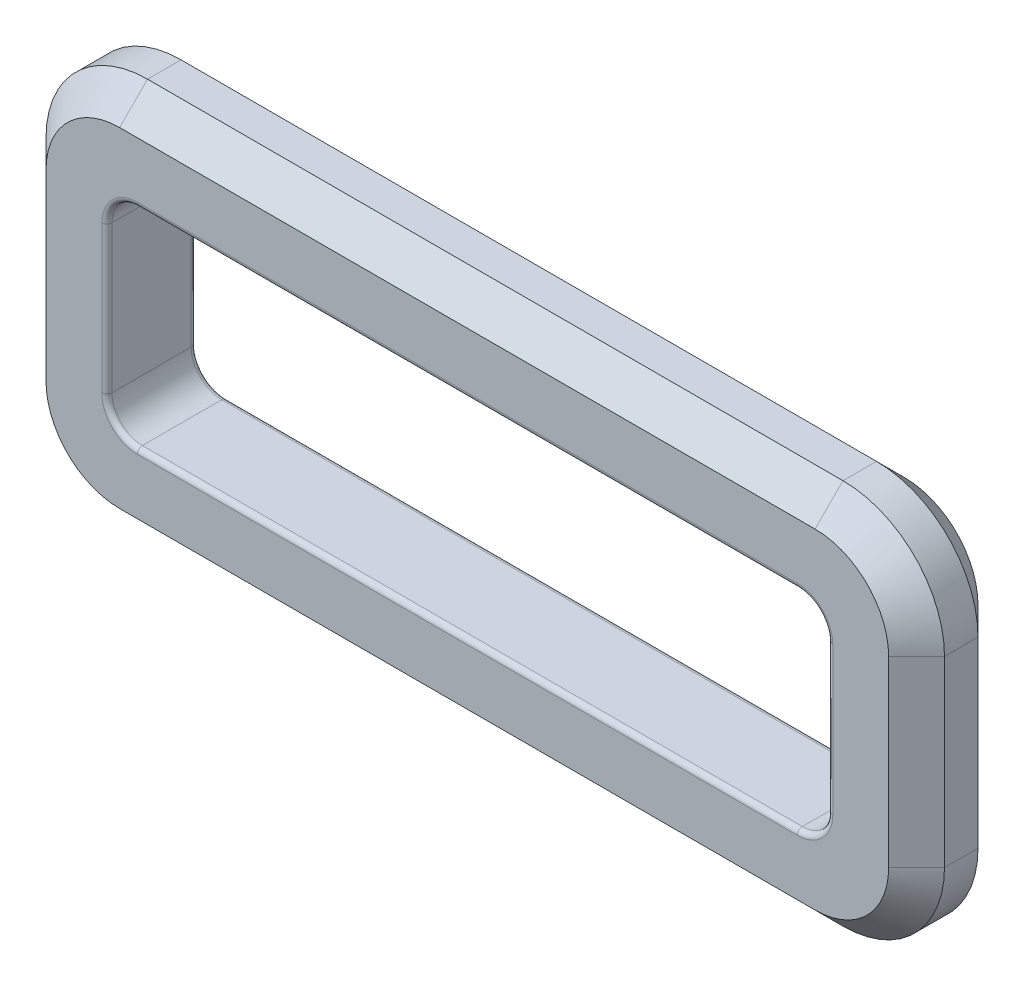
ISO-10303-21;
HEADER;
FILE_DESCRIPTION(('STEP AP214'),'2;1');
FILE_NAME('part.step','',(''),(''),'','','');
FILE_SCHEMA(('AUTOMOTIVE_DESIGN { 1 0 10303 214 1 1 1 1 }'));
ENDSEC;
DATA;
#1=APPLICATION_CONTEXT('core data for automotive mechanical design processes');
#2=APPLICATION_PROTOCOL_DEFINITION('international standard','automotive_design',2000,#1);
#3=PRODUCT_CONTEXT('',#1,'mechanical');
#4=PRODUCT('Part','Part','',(#3));
#5=PRODUCT_RELATED_PRODUCT_CATEGORY('part','',(#4));
#6=PRODUCT_DEFINITION_FORMATION('','',#4);
#7=PRODUCT_DEFINITION_CONTEXT('part definition',#1,'design');
#8=PRODUCT_DEFINITION('design','',#6,#7);
#9=PRODUCT_DEFINITION_SHAPE('','',#8);
#10=(LENGTH_UNIT() NAMED_UNIT(*) SI_UNIT(.MILLI.,.METRE.));
#11=(NAMED_UNIT(*) PLANE_ANGLE_UNIT() SI_UNIT($,.RADIAN.));
#12=(NAMED_UNIT(*) SI_UNIT($,.STERADIAN.) SOLID_ANGLE_UNIT());
#13=UNCERTAINTY_MEASURE_WITH_UNIT(LENGTH_MEASURE(1.E-05),#10,'distance_accuracy_value','');
#14=(GEOMETRIC_REPRESENTATION_CONTEXT(3) GLOBAL_UNCERTAINTY_ASSIGNED_CONTEXT((#13)) GLOBAL_UNIT_ASSIGNED_CONTEXT((#10,
#11,#12)) REPRESENTATION_CONTEXT('',''));
#15=CARTESIAN_POINT('',(0.,0.,0.));
#16=DIRECTION('',(0.,0.,1.));
#17=DIRECTION('',(1.,0.,0.));
#18=AXIS2_PLACEMENT_3D('',#15,#16,#17);
#19=CARTESIAN_POINT('',(3.425,-0.9,0.88));
#20=DIRECTION('',(0.,0.,1.));
#21=DIRECTION('',(1.,0.,0.));
#22=AXIS2_PLACEMENT_3D('',#19,#20,#21);
#23=PLANE('',#22);
#24=CARTESIAN_POINT('',(-3.425,-0.9,0.88));
#25=DIRECTION('',(0.,0.,1.));
#26=DIRECTION('',(1.,0.,0.));
#27=AXIS2_PLACEMENT_3D('',#24,#25,#26);
#28=CIRCLE('',#27,0.724999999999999);
#29=CARTESIAN_POINT('',(-4.15,-0.9,0.88));
#30=VERTEX_POINT('',#29);
#31=CARTESIAN_POINT('',(-3.42499999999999,-1.625,0.88));
#32=VERTEX_POINT('',#31);
#33=EDGE_CURVE('E67',#30,#32,#28,.T.);
#34=ORIENTED_EDGE('',*,*,#33,.T.);
#35=DIRECTION('',(1.,0.,0.));
#36=VECTOR('',#35,1.);
#37=CARTESIAN_POINT('',(3.42499999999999,-1.625,0.88));
#38=LINE('',#37,#36);
#39=CARTESIAN_POINT('',(3.42499999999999,-1.625,0.88));
#40=VERTEX_POINT('',#39);
#41=EDGE_CURVE('E11',#32,#40,#38,.T.);
#42=ORIENTED_EDGE('',*,*,#41,.T.);
#43=CARTESIAN_POINT('',(3.425,-0.9,0.88));
#44=DIRECTION('',(0.,0.,1.));
#45=DIRECTION('',(1.,0.,0.));
#46=AXIS2_PLACEMENT_3D('',#43,#44,#45);
#47=CIRCLE('',#46,0.724999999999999);
#48=CARTESIAN_POINT('',(4.15,-0.899999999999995,0.88));
#49=VERTEX_POINT('',#48);
#50=EDGE_CURVE('E52',#40,#49,#47,.T.);
#51=ORIENTED_EDGE('',*,*,#50,.T.);
#52=DIRECTION('',(0.,1.,0.));
#53=VECTOR('',#52,1.);
#54=CARTESIAN_POINT('',(4.15,0.899999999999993,0.88));
#55=LINE('',#54,#53);
#56=CARTESIAN_POINT('',(4.15,0.899999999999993,0.88));
#57=VERTEX_POINT('',#56);
#58=EDGE_CURVE('E507',#49,#57,#55,.T.);
#59=ORIENTED_EDGE('',*,*,#58,.T.);
#60=CARTESIAN_POINT('',(3.425,0.9,0.88));
#61=DIRECTION('',(0.,0.,1.));
#62=DIRECTION('',(1.,0.,0.));
#63=AXIS2_PLACEMENT_3D('',#60,#61,#62);
#64=CIRCLE('',#63,0.724999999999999);
#65=CARTESIAN_POINT('',(3.42499999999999,1.625,0.88));
#66=VERTEX_POINT('',#65);
#67=EDGE_CURVE('E501',#57,#66,#64,.T.);
#68=ORIENTED_EDGE('',*,*,#67,.T.);
#69=DIRECTION('',(-1.,0.,0.));
#70=VECTOR('',#69,1.);
#71=CARTESIAN_POINT('',(-3.42499999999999,1.625,0.88));
#72=LINE('',#71,#70);
#73=CARTESIAN_POINT('',(-3.42499999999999,1.625,0.88));
#74=VERTEX_POINT('',#73);
#75=EDGE_CURVE('E495',#66,#74,#72,.T.);
#76=ORIENTED_EDGE('',*,*,#75,.T.);
#77=CARTESIAN_POINT('',(-3.425,0.9,0.88));
#78=DIRECTION('',(0.,0.,1.));
#79=DIRECTION('',(1.,0.,0.));
#80=AXIS2_PLACEMENT_3D('',#77,#78,#79);
#81=CIRCLE('',#80,0.724999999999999);
#82=CARTESIAN_POINT('',(-4.15,0.899999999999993,0.88));
#83=VERTEX_POINT('',#82);
#84=EDGE_CURVE('E498',#74,#83,#81,.T.);
#85=ORIENTED_EDGE('',*,*,#84,.T.);
#86=DIRECTION('',(0.,-1.,0.));
#87=VECTOR('',#86,1.);
#88=CARTESIAN_POINT('',(-4.15,-0.9,0.88));
#89=LINE('',#88,#87);
#90=EDGE_CURVE('E504',#83,#30,#89,.T.);
#91=ORIENTED_EDGE('',*,*,#90,.T.);
#92=EDGE_LOOP('',(#34,#42,#51,#59,#68,#76,#85,#91));
#93=FACE_BOUND('',#92,.T.);
#94=DIRECTION('',(0.,-1.,0.));
#95=VECTOR('',#94,1.);
#96=CARTESIAN_POINT('',(-3.6,-0.9,0.88));
#97=LINE('',#96,#95);
#98=CARTESIAN_POINT('',(-3.6,-0.724999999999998,0.88));
#99=VERTEX_POINT('',#98);
#100=CARTESIAN_POINT('',(-3.6,0.724999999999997,0.88));
#101=VERTEX_POINT('',#100);
#102=EDGE_CURVE('E334',#99,#101,#97,.F.);
#103=ORIENTED_EDGE('',*,*,#102,.T.);
#104=CARTESIAN_POINT('',(-3.25,0.725,0.88));
#105=DIRECTION('',(0.,0.,1.));
#106=DIRECTION('',(1.,0.,0.));
#107=AXIS2_PLACEMENT_3D('',#104,#105,#106);
#108=CIRCLE('',#107,0.35);
#109=CARTESIAN_POINT('',(-3.25,1.075,0.88));
#110=VERTEX_POINT('',#109);
#111=EDGE_CURVE('E355',#101,#110,#108,.F.);
#112=ORIENTED_EDGE('',*,*,#111,.T.);
#113=DIRECTION('',(-1.,0.,0.));
#114=VECTOR('',#113,1.);
#115=CARTESIAN_POINT('',(3.425,1.075,0.88));
#116=LINE('',#115,#114);
#117=CARTESIAN_POINT('',(3.25,1.075,0.88));
#118=VERTEX_POINT('',#117);
#119=EDGE_CURVE('E352',#110,#118,#116,.F.);
#120=ORIENTED_EDGE('',*,*,#119,.T.);
#121=CARTESIAN_POINT('',(3.25,0.725,0.88));
#122=DIRECTION('',(0.,0.,1.));
#123=DIRECTION('',(1.,0.,0.));
#124=AXIS2_PLACEMENT_3D('',#121,#122,#123);
#125=CIRCLE('',#124,0.35);
#126=CARTESIAN_POINT('',(3.6,0.724999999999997,0.88));
#127=VERTEX_POINT('',#126);
#128=EDGE_CURVE('E349',#118,#127,#125,.F.);
#129=ORIENTED_EDGE('',*,*,#128,.T.);
#130=DIRECTION('',(0.,1.,0.));
#131=VECTOR('',#130,1.);
#132=CARTESIAN_POINT('',(3.6,-0.9,0.88));
#133=LINE('',#132,#131);
#134=CARTESIAN_POINT('',(3.6,-0.725,0.88));
#135=VERTEX_POINT('',#134);
#136=EDGE_CURVE('E346',#127,#135,#133,.F.);
#137=ORIENTED_EDGE('',*,*,#136,.T.);
#138=CARTESIAN_POINT('',(3.25,-0.725,0.88));
#139=DIRECTION('',(0.,0.,1.));
#140=DIRECTION('',(1.,0.,0.));
#141=AXIS2_PLACEMENT_3D('',#138,#139,#140);
#142=CIRCLE('',#141,0.35);
#143=CARTESIAN_POINT('',(3.25,-1.075,0.88));
#144=VERTEX_POINT('',#143);
#145=EDGE_CURVE('E343',#135,#144,#142,.F.);
#146=ORIENTED_EDGE('',*,*,#145,.T.);
#147=DIRECTION('',(1.,0.,0.));
#148=VECTOR('',#147,1.);
#149=CARTESIAN_POINT('',(3.425,-1.075,0.88));
#150=LINE('',#149,#148);
#151=CARTESIAN_POINT('',(-3.25,-1.075,0.88));
#152=VERTEX_POINT('',#151);
#153=EDGE_CURVE('E340',#144,#152,#150,.F.);
#154=ORIENTED_EDGE('',*,*,#153,.T.);
#155=CARTESIAN_POINT('',(-3.25,-0.725,0.88));
#156=DIRECTION('',(0.,0.,1.));
#157=DIRECTION('',(1.,0.,0.));
#158=AXIS2_PLACEMENT_3D('',#155,#156,#157);
#159=CIRCLE('',#158,0.35);
#160=EDGE_CURVE('E337',#152,#99,#159,.F.);
#161=ORIENTED_EDGE('',*,*,#160,.T.);
#162=EDGE_LOOP('',(#103,#112,#120,#129,#137,#146,#154,#161));
#163=FACE_BOUND('',#162,.T.);
#164=ADVANCED_FACE('F41',(#93,#163),#23,.T.);
#165=CARTESIAN_POINT('',(3.425,-0.9,0.));
#166=DIRECTION('',(0.,0.,1.));
#167=DIRECTION('',(1.,0.,0.));
#168=AXIS2_PLACEMENT_3D('',#165,#166,#167);
#169=PLANE('',#168);
#170=CARTESIAN_POINT('',(3.425,-0.9,0.));
#171=DIRECTION('',(0.,0.,1.));
#172=DIRECTION('',(1.,0.,0.));
#173=AXIS2_PLACEMENT_3D('',#170,#171,#172);
#174=CIRCLE('',#173,0.725);
#175=CARTESIAN_POINT('',(4.15,-0.899999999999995,0.));
#176=VERTEX_POINT('',#175);
#177=CARTESIAN_POINT('',(3.42499999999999,-1.625,0.));
#178=VERTEX_POINT('',#177);
#179=EDGE_CURVE('E446',#176,#178,#174,.F.);
#180=ORIENTED_EDGE('',*,*,#179,.T.);
#181=DIRECTION('',(-1.,0.,0.));
#182=VECTOR('',#181,1.);
#183=CARTESIAN_POINT('',(3.425,-1.625,0.));
#184=LINE('',#183,#182);
#185=CARTESIAN_POINT('',(-3.42499999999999,-1.625,0.));
#186=VERTEX_POINT('',#185);
#187=EDGE_CURVE('E449',#178,#186,#184,.T.);
#188=ORIENTED_EDGE('',*,*,#187,.T.);
#189=CARTESIAN_POINT('',(-3.425,-0.9,0.));
#190=DIRECTION('',(0.,0.,1.));
#191=DIRECTION('',(1.,0.,0.));
#192=AXIS2_PLACEMENT_3D('',#189,#190,#191);
#193=CIRCLE('',#192,0.725);
#194=CARTESIAN_POINT('',(-4.15,-0.9,0.));
#195=VERTEX_POINT('',#194);
#196=EDGE_CURVE('E443',#186,#195,#193,.F.);
#197=ORIENTED_EDGE('',*,*,#196,.T.);
#198=DIRECTION('',(0.,1.,0.));
#199=VECTOR('',#198,1.);
#200=CARTESIAN_POINT('',(-4.15,-0.9,0.));
#201=LINE('',#200,#199);
#202=CARTESIAN_POINT('',(-4.15,0.899999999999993,0.));
#203=VERTEX_POINT('',#202);
#204=EDGE_CURVE('E437',#195,#203,#201,.T.);
#205=ORIENTED_EDGE('',*,*,#204,.T.);
#206=CARTESIAN_POINT('',(-3.425,0.9,0.));
#207=DIRECTION('',(0.,0.,1.));
#208=DIRECTION('',(1.,0.,0.));
#209=AXIS2_PLACEMENT_3D('',#206,#207,#208);
#210=CIRCLE('',#209,0.725);
#211=CARTESIAN_POINT('',(-3.42499999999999,1.625,0.));
#212=VERTEX_POINT('',#211);
#213=EDGE_CURVE('E431',#203,#212,#210,.F.);
#214=ORIENTED_EDGE('',*,*,#213,.T.);
#215=DIRECTION('',(1.,0.,0.));
#216=VECTOR('',#215,1.);
#217=CARTESIAN_POINT('',(3.425,1.625,0.));
#218=LINE('',#217,#216);
#219=CARTESIAN_POINT('',(3.42499999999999,1.625,0.));
#220=VERTEX_POINT('',#219);
#221=EDGE_CURVE('E428',#212,#220,#218,.T.);
#222=ORIENTED_EDGE('',*,*,#221,.T.);
#223=CARTESIAN_POINT('',(3.425,0.9,0.));
#224=DIRECTION('',(0.,0.,1.));
#225=DIRECTION('',(1.,0.,0.));
#226=AXIS2_PLACEMENT_3D('',#223,#224,#225);
#227=CIRCLE('',#226,0.725);
#228=CARTESIAN_POINT('',(4.15,0.899999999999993,0.));
#229=VERTEX_POINT('',#228);
#230=EDGE_CURVE('E434',#220,#229,#227,.F.);
#231=ORIENTED_EDGE('',*,*,#230,.T.);
#232=DIRECTION('',(0.,-1.,0.));
#233=VECTOR('',#232,1.);
#234=CARTESIAN_POINT('',(4.15,-0.9,0.));
#235=LINE('',#234,#233);
#236=EDGE_CURVE('E440',#229,#176,#235,.T.);
#237=ORIENTED_EDGE('',*,*,#236,.T.);
#238=EDGE_LOOP('',(#180,#188,#197,#205,#214,#222,#231,#237));
#239=FACE_BOUND('',#238,.T.);
#240=DIRECTION('',(-1.,0.,0.));
#241=VECTOR('',#240,1.);
#242=CARTESIAN_POINT('',(-3.25,1.075,0.));
#243=LINE('',#242,#241);
#244=CARTESIAN_POINT('',(3.25,1.075,0.));
#245=VERTEX_POINT('',#244);
#246=CARTESIAN_POINT('',(-3.25,1.075,0.));
#247=VERTEX_POINT('',#246);
#248=EDGE_CURVE('E283',#245,#247,#243,.T.);
#249=ORIENTED_EDGE('',*,*,#248,.T.);
#250=CARTESIAN_POINT('',(-3.25,0.725,0.));
#251=DIRECTION('',(0.,0.,1.));
#252=DIRECTION('',(1.,0.,0.));
#253=AXIS2_PLACEMENT_3D('',#250,#251,#252);
#254=CIRCLE('',#253,0.35);
#255=CARTESIAN_POINT('',(-3.6,0.724999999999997,0.));
#256=VERTEX_POINT('',#255);
#257=EDGE_CURVE('E261',#247,#256,#254,.T.);
#258=ORIENTED_EDGE('',*,*,#257,.T.);
#259=DIRECTION('',(0.,-1.,0.));
#260=VECTOR('',#259,1.);
#261=CARTESIAN_POINT('',(-3.6,-0.724999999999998,0.));
#262=LINE('',#261,#260);
#263=CARTESIAN_POINT('',(-3.6,-0.724999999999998,0.));
#264=VERTEX_POINT('',#263);
#265=EDGE_CURVE('E271',#256,#264,#262,.T.);
#266=ORIENTED_EDGE('',*,*,#265,.T.);
#267=CARTESIAN_POINT('',(-3.25,-0.725,0.));
#268=DIRECTION('',(0.,0.,1.));
#269=DIRECTION('',(1.,0.,0.));
#270=AXIS2_PLACEMENT_3D('',#267,#268,#269);
#271=CIRCLE('',#270,0.35);
#272=CARTESIAN_POINT('',(-3.25,-1.075,0.));
#273=VERTEX_POINT('',#272);
#274=EDGE_CURVE('E278',#264,#273,#271,.T.);
#275=ORIENTED_EDGE('',*,*,#274,.T.);
#276=DIRECTION('',(1.,0.,0.));
#277=VECTOR('',#276,1.);
#278=CARTESIAN_POINT('',(3.25,-1.075,0.));
#279=LINE('',#278,#277);
#280=CARTESIAN_POINT('',(3.25,-1.075,0.));
#281=VERTEX_POINT('',#280);
#282=EDGE_CURVE('E610',#273,#281,#279,.T.);
#283=ORIENTED_EDGE('',*,*,#282,.T.);
#284=CARTESIAN_POINT('',(3.25,-0.725,0.));
#285=DIRECTION('',(0.,0.,1.));
#286=DIRECTION('',(1.,0.,0.));
#287=AXIS2_PLACEMENT_3D('',#284,#285,#286);
#288=CIRCLE('',#287,0.35);
#289=CARTESIAN_POINT('',(3.6,-0.725,0.));
#290=VERTEX_POINT('',#289);
#291=EDGE_CURVE('E613',#281,#290,#288,.T.);
#292=ORIENTED_EDGE('',*,*,#291,.T.);
#293=DIRECTION('',(0.,1.,0.));
#294=VECTOR('',#293,1.);
#295=CARTESIAN_POINT('',(3.6,0.724999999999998,0.));
#296=LINE('',#295,#294);
#297=CARTESIAN_POINT('',(3.6,0.724999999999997,0.));
#298=VERTEX_POINT('',#297);
#299=EDGE_CURVE('E616',#290,#298,#296,.T.);
#300=ORIENTED_EDGE('',*,*,#299,.T.);
#301=CARTESIAN_POINT('',(3.25,0.725,0.));
#302=DIRECTION('',(0.,0.,1.));
#303=DIRECTION('',(1.,0.,0.));
#304=AXIS2_PLACEMENT_3D('',#301,#302,#303);
#305=CIRCLE('',#304,0.35);
#306=EDGE_CURVE('E292',#298,#245,#305,.T.);
#307=ORIENTED_EDGE('',*,*,#306,.T.);
#308=EDGE_LOOP('',(#249,#258,#266,#275,#283,#292,#300,#307));
#309=FACE_BOUND('',#308,.T.);
#310=ADVANCED_FACE('F281',(#239,#309),#169,.F.);
#311=CARTESIAN_POINT('',(3.425,-0.9,0.88));
#312=DIRECTION('',(0.,0.,-1.));
#313=DIRECTION('',(-1.,0.,0.));
#314=AXIS2_PLACEMENT_3D('',#311,#312,#313);
#315=CYLINDRICAL_SURFACE('',#314,1.);
#316=DIRECTION('',(0.,0.,-1.));
#317=VECTOR('',#316,1.);
#318=CARTESIAN_POINT('',(3.42499999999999,-1.9,0.88));
#319=LINE('',#318,#317);
#320=CARTESIAN_POINT('',(3.42499999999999,-1.9,0.604999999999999));
#321=VERTEX_POINT('',#320);
#322=CARTESIAN_POINT('',(3.42499999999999,-1.9,0.274999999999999));
#323=VERTEX_POINT('',#322);
#324=EDGE_CURVE('E648',#321,#323,#319,.T.);
#325=ORIENTED_EDGE('',*,*,#324,.T.);
#326=CARTESIAN_POINT('',(3.425,-0.9,0.274999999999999));
#327=DIRECTION('',(0.,0.,1.));
#328=DIRECTION('',(1.,0.,0.));
#329=AXIS2_PLACEMENT_3D('',#326,#327,#328);
#330=CIRCLE('',#329,1.);
#331=CARTESIAN_POINT('',(4.425,-0.899999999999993,0.274999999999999));
#332=VERTEX_POINT('',#331);
#333=EDGE_CURVE('E456',#323,#332,#330,.T.);
#334=ORIENTED_EDGE('',*,*,#333,.T.);
#335=DIRECTION('',(0.,0.,-1.));
#336=VECTOR('',#335,1.);
#337=CARTESIAN_POINT('',(4.425,-0.899999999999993,0.88));
#338=LINE('',#337,#336);
#339=CARTESIAN_POINT('',(4.425,-0.899999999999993,0.604999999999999));
#340=VERTEX_POINT('',#339);
#341=EDGE_CURVE('E279',#340,#332,#338,.T.);
#342=ORIENTED_EDGE('',*,*,#341,.F.);
#343=CARTESIAN_POINT('',(3.425,-0.9,0.604999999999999));
#344=DIRECTION('',(0.,0.,1.));
#345=DIRECTION('',(1.,0.,0.));
#346=AXIS2_PLACEMENT_3D('',#343,#344,#345);
#347=CIRCLE('',#346,1.);
#348=EDGE_CURVE('E453',#340,#321,#347,.F.);
#349=ORIENTED_EDGE('',*,*,#348,.T.);
#350=EDGE_LOOP('',(#325,#334,#342,#349));
#351=FACE_BOUND('',#350,.T.);
#352=ADVANCED_FACE('F1147',(#351),#315,.T.);
#353=CARTESIAN_POINT('',(4.425,-0.899999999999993,0.88));
#354=DIRECTION('',(-1.,0.,0.));
#355=DIRECTION('',(0.,0.,1.));
#356=AXIS2_PLACEMENT_3D('',#353,#354,#355);
#357=PLANE('',#356);
#358=ORIENTED_EDGE('',*,*,#341,.T.);
#359=DIRECTION('',(0.,1.,0.));
#360=VECTOR('',#359,1.);
#361=CARTESIAN_POINT('',(4.425,-0.899999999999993,0.274999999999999));
#362=LINE('',#361,#360);
#363=CARTESIAN_POINT('',(4.425,0.899999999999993,0.274999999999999));
#364=VERTEX_POINT('',#363);
#365=EDGE_CURVE('E468',#332,#364,#362,.T.);
#366=ORIENTED_EDGE('',*,*,#365,.T.);
#367=DIRECTION('',(0.,0.,-1.));
#368=VECTOR('',#367,1.);
#369=CARTESIAN_POINT('',(4.425,0.899999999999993,0.88));
#370=LINE('',#369,#368);
#371=CARTESIAN_POINT('',(4.425,0.899999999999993,0.604999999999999));
#372=VERTEX_POINT('',#371);
#373=EDGE_CURVE('E596',#372,#364,#370,.T.);
#374=ORIENTED_EDGE('',*,*,#373,.F.);
#375=DIRECTION('',(0.,-1.,0.));
#376=VECTOR('',#375,1.);
#377=CARTESIAN_POINT('',(4.425,-0.899999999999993,0.604999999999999));
#378=LINE('',#377,#376);
#379=EDGE_CURVE('E465',#372,#340,#378,.T.);
#380=ORIENTED_EDGE('',*,*,#379,.T.);
#381=EDGE_LOOP('',(#358,#366,#374,#380));
#382=FACE_BOUND('',#381,.T.);
#383=ADVANCED_FACE('F1140',(#382),#357,.F.);
#384=CARTESIAN_POINT('',(3.425,0.9,0.88));
#385=DIRECTION('',(0.,0.,-1.));
#386=DIRECTION('',(-1.,0.,0.));
#387=AXIS2_PLACEMENT_3D('',#384,#385,#386);
#388=CYLINDRICAL_SURFACE('',#387,1.);
#389=ORIENTED_EDGE('',*,*,#373,.T.);
#390=CARTESIAN_POINT('',(3.425,0.9,0.274999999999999));
#391=DIRECTION('',(0.,0.,1.));
#392=DIRECTION('',(1.,0.,0.));
#393=AXIS2_PLACEMENT_3D('',#390,#391,#392);
#394=CIRCLE('',#393,1.);
#395=CARTESIAN_POINT('',(3.42499999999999,1.9,0.274999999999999));
#396=VERTEX_POINT('',#395);
#397=EDGE_CURVE('E480',#364,#396,#394,.T.);
#398=ORIENTED_EDGE('',*,*,#397,.T.);
#399=DIRECTION('',(0.,0.,-1.));
#400=VECTOR('',#399,1.);
#401=CARTESIAN_POINT('',(3.42499999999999,1.9,0.88));
#402=LINE('',#401,#400);
#403=CARTESIAN_POINT('',(3.42499999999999,1.9,0.604999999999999));
#404=VERTEX_POINT('',#403);
#405=EDGE_CURVE('E586',#404,#396,#402,.T.);
#406=ORIENTED_EDGE('',*,*,#405,.F.);
#407=CARTESIAN_POINT('',(3.425,0.9,0.604999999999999));
#408=DIRECTION('',(0.,0.,1.));
#409=DIRECTION('',(1.,0.,0.));
#410=AXIS2_PLACEMENT_3D('',#407,#408,#409);
#411=CIRCLE('',#410,1.);
#412=EDGE_CURVE('E477',#404,#372,#411,.F.);
#413=ORIENTED_EDGE('',*,*,#412,.T.);
#414=EDGE_LOOP('',(#389,#398,#406,#413));
#415=FACE_BOUND('',#414,.T.);
#416=ADVANCED_FACE('F592',(#415),#388,.T.);
#417=CARTESIAN_POINT('',(-3.42499999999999,1.9,0.88));
#418=DIRECTION('',(0.,-1.,0.));
#419=DIRECTION('',(0.,0.,-1.));
#420=AXIS2_PLACEMENT_3D('',#417,#418,#419);
#421=PLANE('',#420);
#422=ORIENTED_EDGE('',*,*,#405,.T.);
#423=DIRECTION('',(-1.,0.,0.));
#424=VECTOR('',#423,1.);
#425=CARTESIAN_POINT('',(-3.42499999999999,1.9,0.274999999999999));
#426=LINE('',#425,#424);
#427=CARTESIAN_POINT('',(-3.42499999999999,1.9,0.274999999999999));
#428=VERTEX_POINT('',#427);
#429=EDGE_CURVE('E492',#396,#428,#426,.T.);
#430=ORIENTED_EDGE('',*,*,#429,.T.);
#431=DIRECTION('',(0.,0.,-1.));
#432=VECTOR('',#431,1.);
#433=CARTESIAN_POINT('',(-3.42499999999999,1.9,0.88));
#434=LINE('',#433,#432);
#435=CARTESIAN_POINT('',(-3.42499999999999,1.9,0.604999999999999));
#436=VERTEX_POINT('',#435);
#437=EDGE_CURVE('E589',#436,#428,#434,.T.);
#438=ORIENTED_EDGE('',*,*,#437,.F.);
#439=DIRECTION('',(1.,0.,0.));
#440=VECTOR('',#439,1.);
#441=CARTESIAN_POINT('',(3.42499999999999,1.9,0.604999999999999));
#442=LINE('',#441,#440);
#443=EDGE_CURVE('E489',#436,#404,#442,.T.);
#444=ORIENTED_EDGE('',*,*,#443,.T.);
#445=EDGE_LOOP('',(#422,#430,#438,#444));
#446=FACE_BOUND('',#445,.T.);
#447=ADVANCED_FACE('F585',(#446),#421,.F.);
#448=CARTESIAN_POINT('',(-3.425,0.9,0.88));
#449=DIRECTION('',(0.,0.,-1.));
#450=DIRECTION('',(-1.,0.,0.));
#451=AXIS2_PLACEMENT_3D('',#448,#449,#450);
#452=CYLINDRICAL_SURFACE('',#451,1.);
#453=ORIENTED_EDGE('',*,*,#437,.T.);
#454=CARTESIAN_POINT('',(-3.425,0.9,0.274999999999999));
#455=DIRECTION('',(0.,0.,1.));
#456=DIRECTION('',(1.,0.,0.));
#457=AXIS2_PLACEMENT_3D('',#454,#455,#456);
#458=CIRCLE('',#457,1.);
#459=CARTESIAN_POINT('',(-4.425,0.899999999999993,0.274999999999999));
#460=VERTEX_POINT('',#459);
#461=EDGE_CURVE('E486',#428,#460,#458,.T.);
#462=ORIENTED_EDGE('',*,*,#461,.T.);
#463=DIRECTION('',(0.,0.,-1.));
#464=VECTOR('',#463,1.);
#465=CARTESIAN_POINT('',(-4.425,0.899999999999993,0.88));
#466=LINE('',#465,#464);
#467=CARTESIAN_POINT('',(-4.425,0.899999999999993,0.604999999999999));
#468=VERTEX_POINT('',#467);
#469=EDGE_CURVE('E601',#468,#460,#466,.T.);
#470=ORIENTED_EDGE('',*,*,#469,.F.);
#471=CARTESIAN_POINT('',(-3.425,0.9,0.604999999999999));
#472=DIRECTION('',(0.,0.,1.));
#473=DIRECTION('',(1.,0.,0.));
#474=AXIS2_PLACEMENT_3D('',#471,#472,#473);
#475=CIRCLE('',#474,1.);
#476=EDGE_CURVE('E483',#468,#436,#475,.F.);
#477=ORIENTED_EDGE('',*,*,#476,.T.);
#478=EDGE_LOOP('',(#453,#462,#470,#477));
#479=FACE_BOUND('',#478,.T.);
#480=ADVANCED_FACE('F1121',(#479),#452,.T.);
#481=CARTESIAN_POINT('',(-4.425,-0.899999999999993,0.88));
#482=DIRECTION('',(1.,0.,0.));
#483=DIRECTION('',(0.,0.,-1.));
#484=AXIS2_PLACEMENT_3D('',#481,#482,#483);
#485=PLANE('',#484);
#486=ORIENTED_EDGE('',*,*,#469,.T.);
#487=DIRECTION('',(0.,-1.,0.));
#488=VECTOR('',#487,1.);
#489=CARTESIAN_POINT('',(-4.425,-0.899999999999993,0.274999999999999));
#490=LINE('',#489,#488);
#491=CARTESIAN_POINT('',(-4.425,-0.9,0.274999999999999));
#492=VERTEX_POINT('',#491);
#493=EDGE_CURVE('E474',#460,#492,#490,.T.);
#494=ORIENTED_EDGE('',*,*,#493,.T.);
#495=DIRECTION('',(0.,0.,-1.));
#496=VECTOR('',#495,1.);
#497=CARTESIAN_POINT('',(-4.425,-0.9,0.88));
#498=LINE('',#497,#496);
#499=CARTESIAN_POINT('',(-4.425,-0.9,0.604999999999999));
#500=VERTEX_POINT('',#499);
#501=EDGE_CURVE('E661',#500,#492,#498,.T.);
#502=ORIENTED_EDGE('',*,*,#501,.F.);
#503=DIRECTION('',(0.,1.,0.));
#504=VECTOR('',#503,1.);
#505=CARTESIAN_POINT('',(-4.425,0.899999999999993,0.604999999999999));
#506=LINE('',#505,#504);
#507=EDGE_CURVE('E471',#500,#468,#506,.T.);
#508=ORIENTED_EDGE('',*,*,#507,.T.);
#509=EDGE_LOOP('',(#486,#494,#502,#508));
#510=FACE_BOUND('',#509,.T.);
#511=ADVANCED_FACE('F669',(#510),#485,.F.);
#512=CARTESIAN_POINT('',(-3.425,-0.9,0.88));
#513=DIRECTION('',(0.,0.,-1.));
#514=DIRECTION('',(-1.,0.,0.));
#515=AXIS2_PLACEMENT_3D('',#512,#513,#514);
#516=CYLINDRICAL_SURFACE('',#515,1.);
#517=ORIENTED_EDGE('',*,*,#501,.T.);
#518=CARTESIAN_POINT('',(-3.425,-0.9,0.274999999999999));
#519=DIRECTION('',(0.,0.,1.));
#520=DIRECTION('',(1.,0.,0.));
#521=AXIS2_PLACEMENT_3D('',#518,#519,#520);
#522=CIRCLE('',#521,1.);
#523=CARTESIAN_POINT('',(-3.42499999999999,-1.9,0.274999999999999));
#524=VERTEX_POINT('',#523);
#525=EDGE_CURVE('E462',#492,#524,#522,.T.);
#526=ORIENTED_EDGE('',*,*,#525,.T.);
#527=DIRECTION('',(0.,0.,-1.));
#528=VECTOR('',#527,1.);
#529=CARTESIAN_POINT('',(-3.42499999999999,-1.9,0.88));
#530=LINE('',#529,#528);
#531=CARTESIAN_POINT('',(-3.42499999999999,-1.9,0.604999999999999));
#532=VERTEX_POINT('',#531);
#533=EDGE_CURVE('E657',#532,#524,#530,.T.);
#534=ORIENTED_EDGE('',*,*,#533,.F.);
#535=CARTESIAN_POINT('',(-3.425,-0.9,0.604999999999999));
#536=DIRECTION('',(0.,0.,1.));
#537=DIRECTION('',(1.,0.,0.));
#538=AXIS2_PLACEMENT_3D('',#535,#536,#537);
#539=CIRCLE('',#538,1.);
#540=EDGE_CURVE('E459',#532,#500,#539,.F.);
#541=ORIENTED_EDGE('',*,*,#540,.T.);
#542=EDGE_LOOP('',(#517,#526,#534,#541));
#543=FACE_BOUND('',#542,.T.);
#544=ADVANCED_FACE('F690',(#543),#516,.T.);
#545=CARTESIAN_POINT('',(-3.42499999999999,-1.9,0.88));
#546=DIRECTION('',(0.,1.,0.));
#547=DIRECTION('',(0.,0.,1.));
#548=AXIS2_PLACEMENT_3D('',#545,#546,#547);
#549=PLANE('',#548);
#550=ORIENTED_EDGE('',*,*,#533,.T.);
#551=DIRECTION('',(1.,0.,0.));
#552=VECTOR('',#551,1.);
#553=CARTESIAN_POINT('',(-3.42499999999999,-1.9,0.274999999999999));
#554=LINE('',#553,#552);
#555=EDGE_CURVE('E424',#524,#323,#554,.T.);
#556=ORIENTED_EDGE('',*,*,#555,.T.);
#557=ORIENTED_EDGE('',*,*,#324,.F.);
#558=DIRECTION('',(-1.,0.,0.));
#559=VECTOR('',#558,1.);
#560=CARTESIAN_POINT('',(-3.42499999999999,-1.9,0.604999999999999));
#561=LINE('',#560,#559);
#562=EDGE_CURVE('E364',#321,#532,#561,.T.);
#563=ORIENTED_EDGE('',*,*,#562,.T.);
#564=EDGE_LOOP('',(#550,#556,#557,#563));
#565=FACE_BOUND('',#564,.T.);
#566=ADVANCED_FACE('F692',(#565),#549,.F.);
#567=CARTESIAN_POINT('',(3.25,0.725,0.88));
#568=DIRECTION('',(0.,0.,-1.));
#569=DIRECTION('',(-1.,0.,0.));
#570=AXIS2_PLACEMENT_3D('',#567,#568,#569);
#571=CYLINDRICAL_SURFACE('',#570,0.3);
#572=DIRECTION('',(0.,0.,-1.));
#573=VECTOR('',#572,1.);
#574=CARTESIAN_POINT('',(3.25,1.025,0.88));
#575=LINE('',#574,#573);
#576=CARTESIAN_POINT('',(3.25,1.025,0.83));
#577=VERTEX_POINT('',#576);
#578=CARTESIAN_POINT('',(3.25,1.025,0.05));
#579=VERTEX_POINT('',#578);
#580=EDGE_CURVE('E644',#577,#579,#575,.T.);
#581=ORIENTED_EDGE('',*,*,#580,.T.);
#582=CARTESIAN_POINT('',(3.25,0.725,0.05));
#583=DIRECTION('',(0.,0.,1.));
#584=DIRECTION('',(1.,0.,0.));
#585=AXIS2_PLACEMENT_3D('',#582,#583,#584);
#586=CIRCLE('',#585,0.3);
#587=CARTESIAN_POINT('',(3.55,0.724999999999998,0.05));
#588=VERTEX_POINT('',#587);
#589=EDGE_CURVE('E307',#579,#588,#586,.F.);
#590=ORIENTED_EDGE('',*,*,#589,.T.);
#591=DIRECTION('',(0.,0.,-1.));
#592=VECTOR('',#591,1.);
#593=CARTESIAN_POINT('',(3.55,0.724999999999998,0.88));
#594=LINE('',#593,#592);
#595=CARTESIAN_POINT('',(3.55,0.724999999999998,0.83));
#596=VERTEX_POINT('',#595);
#597=EDGE_CURVE('E390',#596,#588,#594,.T.);
#598=ORIENTED_EDGE('',*,*,#597,.F.);
#599=CARTESIAN_POINT('',(3.25,0.725,0.83));
#600=DIRECTION('',(0.,0.,1.));
#601=DIRECTION('',(1.,0.,0.));
#602=AXIS2_PLACEMENT_3D('',#599,#600,#601);
#603=CIRCLE('',#602,0.3);
#604=EDGE_CURVE('E304',#596,#577,#603,.T.);
#605=ORIENTED_EDGE('',*,*,#604,.T.);
#606=EDGE_LOOP('',(#581,#590,#598,#605));
#607=FACE_BOUND('',#606,.T.);
#608=ADVANCED_FACE('F1093',(#607),#571,.F.);
#609=CARTESIAN_POINT('',(-3.25,1.025,0.88));
#610=DIRECTION('',(0.,-1.,0.));
#611=DIRECTION('',(0.,0.,-1.));
#612=AXIS2_PLACEMENT_3D('',#609,#610,#611);
#613=PLANE('',#612);
#614=DIRECTION('',(0.,0.,-1.));
#615=VECTOR('',#614,1.);
#616=CARTESIAN_POINT('',(-3.25,1.025,0.88));
#617=LINE('',#616,#615);
#618=CARTESIAN_POINT('',(-3.25,1.025,0.83));
#619=VERTEX_POINT('',#618);
#620=CARTESIAN_POINT('',(-3.25,1.025,0.05));
#621=VERTEX_POINT('',#620);
#622=EDGE_CURVE('E637',#619,#621,#617,.T.);
#623=ORIENTED_EDGE('',*,*,#622,.T.);
#624=DIRECTION('',(-1.,0.,0.));
#625=VECTOR('',#624,1.);
#626=CARTESIAN_POINT('',(3.25,1.025,0.05));
#627=LINE('',#626,#625);
#628=EDGE_CURVE('E301',#621,#579,#627,.F.);
#629=ORIENTED_EDGE('',*,*,#628,.T.);
#630=ORIENTED_EDGE('',*,*,#580,.F.);
#631=DIRECTION('',(-1.,0.,0.));
#632=VECTOR('',#631,1.);
#633=CARTESIAN_POINT('',(-3.25,1.025,0.83));
#634=LINE('',#633,#632);
#635=EDGE_CURVE('E298',#577,#619,#634,.T.);
#636=ORIENTED_EDGE('',*,*,#635,.T.);
#637=EDGE_LOOP('',(#623,#629,#630,#636));
#638=FACE_BOUND('',#637,.T.);
#639=ADVANCED_FACE('F641',(#638),#613,.T.);
#640=CARTESIAN_POINT('',(-3.25,0.725,0.88));
#641=DIRECTION('',(0.,0.,-1.));
#642=DIRECTION('',(-1.,0.,0.));
#643=AXIS2_PLACEMENT_3D('',#640,#641,#642);
#644=CYLINDRICAL_SURFACE('',#643,0.3);
#645=DIRECTION('',(0.,0.,-1.));
#646=VECTOR('',#645,1.);
#647=CARTESIAN_POINT('',(-3.55,0.724999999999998,0.88));
#648=LINE('',#647,#646);
#649=CARTESIAN_POINT('',(-3.55,0.724999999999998,0.83));
#650=VERTEX_POINT('',#649);
#651=CARTESIAN_POINT('',(-3.55,0.724999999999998,0.05));
#652=VERTEX_POINT('',#651);
#653=EDGE_CURVE('E640',#650,#652,#648,.T.);
#654=ORIENTED_EDGE('',*,*,#653,.T.);
#655=CARTESIAN_POINT('',(-3.25,0.725,0.05));
#656=DIRECTION('',(0.,0.,1.));
#657=DIRECTION('',(1.,0.,0.));
#658=AXIS2_PLACEMENT_3D('',#655,#656,#657);
#659=CIRCLE('',#658,0.3);
#660=EDGE_CURVE('E263',#652,#621,#659,.F.);
#661=ORIENTED_EDGE('',*,*,#660,.T.);
#662=ORIENTED_EDGE('',*,*,#622,.F.);
#663=CARTESIAN_POINT('',(-3.25,0.725,0.83));
#664=DIRECTION('',(0.,0.,1.));
#665=DIRECTION('',(1.,0.,0.));
#666=AXIS2_PLACEMENT_3D('',#663,#664,#665);
#667=CIRCLE('',#666,0.3);
#668=EDGE_CURVE('E286',#619,#650,#667,.T.);
#669=ORIENTED_EDGE('',*,*,#668,.T.);
#670=EDGE_LOOP('',(#654,#661,#662,#669));
#671=FACE_BOUND('',#670,.T.);
#672=ADVANCED_FACE('F636',(#671),#644,.F.);
#673=CARTESIAN_POINT('',(-3.55,-0.724999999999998,0.88));
#674=DIRECTION('',(1.,0.,0.));
#675=DIRECTION('',(0.,0.,-1.));
#676=AXIS2_PLACEMENT_3D('',#673,#674,#675);
#677=PLANE('',#676);
#678=DIRECTION('',(0.,0.,-1.));
#679=VECTOR('',#678,1.);
#680=CARTESIAN_POINT('',(-3.55,-0.724999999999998,0.88));
#681=LINE('',#680,#679);
#682=CARTESIAN_POINT('',(-3.55,-0.724999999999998,0.83));
#683=VERTEX_POINT('',#682);
#684=CARTESIAN_POINT('',(-3.55,-0.724999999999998,0.05));
#685=VERTEX_POINT('',#684);
#686=EDGE_CURVE('E650',#683,#685,#681,.T.);
#687=ORIENTED_EDGE('',*,*,#686,.T.);
#688=DIRECTION('',(0.,-1.,0.));
#689=VECTOR('',#688,1.);
#690=CARTESIAN_POINT('',(-3.55,0.724999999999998,0.05));
#691=LINE('',#690,#689);
#692=EDGE_CURVE('E362',#685,#652,#691,.F.);
#693=ORIENTED_EDGE('',*,*,#692,.T.);
#694=ORIENTED_EDGE('',*,*,#653,.F.);
#695=DIRECTION('',(0.,-1.,0.));
#696=VECTOR('',#695,1.);
#697=CARTESIAN_POINT('',(-3.55,-0.724999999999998,0.83));
#698=LINE('',#697,#696);
#699=EDGE_CURVE('E359',#650,#683,#698,.T.);
#700=ORIENTED_EDGE('',*,*,#699,.T.);
#701=EDGE_LOOP('',(#687,#693,#694,#700));
#702=FACE_BOUND('',#701,.T.);
#703=ADVANCED_FACE('F719',(#702),#677,.T.);
#704=CARTESIAN_POINT('',(-3.25,-0.725,0.88));
#705=DIRECTION('',(0.,0.,-1.));
#706=DIRECTION('',(-1.,0.,0.));
#707=AXIS2_PLACEMENT_3D('',#704,#705,#706);
#708=CYLINDRICAL_SURFACE('',#707,0.3);
#709=DIRECTION('',(0.,0.,-1.));
#710=VECTOR('',#709,1.);
#711=CARTESIAN_POINT('',(-3.25,-1.025,0.88));
#712=LINE('',#711,#710);
#713=CARTESIAN_POINT('',(-3.25,-1.025,0.83));
#714=VERTEX_POINT('',#713);
#715=CARTESIAN_POINT('',(-3.25,-1.025,0.05));
#716=VERTEX_POINT('',#715);
#717=EDGE_CURVE('E723',#714,#716,#712,.T.);
#718=ORIENTED_EDGE('',*,*,#717,.T.);
#719=CARTESIAN_POINT('',(-3.25,-0.725,0.05));
#720=DIRECTION('',(0.,0.,1.));
#721=DIRECTION('',(1.,0.,0.));
#722=AXIS2_PLACEMENT_3D('',#719,#720,#721);
#723=CIRCLE('',#722,0.3);
#724=EDGE_CURVE('E331',#716,#685,#723,.F.);
#725=ORIENTED_EDGE('',*,*,#724,.T.);
#726=ORIENTED_EDGE('',*,*,#686,.F.);
#727=CARTESIAN_POINT('',(-3.25,-0.725,0.83));
#728=DIRECTION('',(0.,0.,1.));
#729=DIRECTION('',(1.,0.,0.));
#730=AXIS2_PLACEMENT_3D('',#727,#728,#729);
#731=CIRCLE('',#730,0.3);
#732=EDGE_CURVE('E328',#683,#714,#731,.T.);
#733=ORIENTED_EDGE('',*,*,#732,.T.);
#734=EDGE_LOOP('',(#718,#725,#726,#733));
#735=FACE_BOUND('',#734,.T.);
#736=ADVANCED_FACE('F765',(#735),#708,.F.);
#737=CARTESIAN_POINT('',(-3.25,-1.025,0.88));
#738=DIRECTION('',(0.,1.,0.));
#739=DIRECTION('',(0.,0.,1.));
#740=AXIS2_PLACEMENT_3D('',#737,#738,#739);
#741=PLANE('',#740);
#742=DIRECTION('',(0.,0.,-1.));
#743=VECTOR('',#742,1.);
#744=CARTESIAN_POINT('',(3.25,-1.025,0.88));
#745=LINE('',#744,#743);
#746=CARTESIAN_POINT('',(3.25,-1.025,0.83));
#747=VERTEX_POINT('',#746);
#748=CARTESIAN_POINT('',(3.25,-1.025,0.05));
#749=VERTEX_POINT('',#748);
#750=EDGE_CURVE('E755',#747,#749,#745,.T.);
#751=ORIENTED_EDGE('',*,*,#750,.T.);
#752=DIRECTION('',(1.,0.,0.));
#753=VECTOR('',#752,1.);
#754=CARTESIAN_POINT('',(-3.25,-1.025,0.05));
#755=LINE('',#754,#753);
#756=EDGE_CURVE('E325',#749,#716,#755,.F.);
#757=ORIENTED_EDGE('',*,*,#756,.T.);
#758=ORIENTED_EDGE('',*,*,#717,.F.);
#759=DIRECTION('',(1.,0.,0.));
#760=VECTOR('',#759,1.);
#761=CARTESIAN_POINT('',(-3.25,-1.025,0.83));
#762=LINE('',#761,#760);
#763=EDGE_CURVE('E322',#714,#747,#762,.T.);
#764=ORIENTED_EDGE('',*,*,#763,.T.);
#765=EDGE_LOOP('',(#751,#757,#758,#764));
#766=FACE_BOUND('',#765,.T.);
#767=ADVANCED_FACE('F768',(#766),#741,.T.);
#768=CARTESIAN_POINT('',(3.25,-0.725,0.88));
#769=DIRECTION('',(0.,0.,-1.));
#770=DIRECTION('',(-1.,0.,0.));
#771=AXIS2_PLACEMENT_3D('',#768,#769,#770);
#772=CYLINDRICAL_SURFACE('',#771,0.3);
#773=DIRECTION('',(0.,0.,-1.));
#774=VECTOR('',#773,1.);
#775=CARTESIAN_POINT('',(3.55,-0.725,0.88));
#776=LINE('',#775,#774);
#777=CARTESIAN_POINT('',(3.55,-0.725,0.83));
#778=VERTEX_POINT('',#777);
#779=CARTESIAN_POINT('',(3.55,-0.725,0.05));
#780=VERTEX_POINT('',#779);
#781=EDGE_CURVE('E746',#778,#780,#776,.T.);
#782=ORIENTED_EDGE('',*,*,#781,.T.);
#783=CARTESIAN_POINT('',(3.25,-0.725,0.05));
#784=DIRECTION('',(0.,0.,1.));
#785=DIRECTION('',(1.,0.,0.));
#786=AXIS2_PLACEMENT_3D('',#783,#784,#785);
#787=CIRCLE('',#786,0.3);
#788=EDGE_CURVE('E319',#780,#749,#787,.F.);
#789=ORIENTED_EDGE('',*,*,#788,.T.);
#790=ORIENTED_EDGE('',*,*,#750,.F.);
#791=CARTESIAN_POINT('',(3.25,-0.725,0.83));
#792=DIRECTION('',(0.,0.,1.));
#793=DIRECTION('',(1.,0.,0.));
#794=AXIS2_PLACEMENT_3D('',#791,#792,#793);
#795=CIRCLE('',#794,0.3);
#796=EDGE_CURVE('E316',#747,#778,#795,.T.);
#797=ORIENTED_EDGE('',*,*,#796,.T.);
#798=EDGE_LOOP('',(#782,#789,#790,#797));
#799=FACE_BOUND('',#798,.T.);
#800=ADVANCED_FACE('F750',(#799),#772,.F.);
#801=CARTESIAN_POINT('',(3.55,-0.724999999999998,0.88));
#802=DIRECTION('',(-1.,0.,0.));
#803=DIRECTION('',(0.,0.,1.));
#804=AXIS2_PLACEMENT_3D('',#801,#802,#803);
#805=PLANE('',#804);
#806=ORIENTED_EDGE('',*,*,#597,.T.);
#807=DIRECTION('',(0.,1.,0.));
#808=VECTOR('',#807,1.);
#809=CARTESIAN_POINT('',(3.55,-0.725,0.05));
#810=LINE('',#809,#808);
#811=EDGE_CURVE('E313',#588,#780,#810,.F.);
#812=ORIENTED_EDGE('',*,*,#811,.T.);
#813=ORIENTED_EDGE('',*,*,#781,.F.);
#814=DIRECTION('',(0.,1.,0.));
#815=VECTOR('',#814,1.);
#816=CARTESIAN_POINT('',(3.55,-0.724999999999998,0.83));
#817=LINE('',#816,#815);
#818=EDGE_CURVE('E310',#778,#596,#817,.T.);
#819=ORIENTED_EDGE('',*,*,#818,.T.);
#820=EDGE_LOOP('',(#806,#812,#813,#819));
#821=FACE_BOUND('',#820,.T.);
#822=ADVANCED_FACE('F745',(#821),#805,.T.);
#823=CARTESIAN_POINT('',(3.25,-0.725,0.05));
#824=DIRECTION('',(0.,0.,1.));
#825=DIRECTION('',(1.,0.,0.));
#826=AXIS2_PLACEMENT_3D('',#823,#824,#825);
#827=TOROIDAL_SURFACE('',#826,0.35,0.05);
#828=CARTESIAN_POINT('',(3.25,-1.075,0.05));
#829=DIRECTION('',(-1.,0.,0.));
#830=DIRECTION('',(0.,-1.,0.));
#831=AXIS2_PLACEMENT_3D('',#828,#829,#830);
#832=CIRCLE('',#831,0.05);
#833=EDGE_CURVE('E382',#749,#281,#832,.T.);
#834=ORIENTED_EDGE('',*,*,#833,.F.);
#835=ORIENTED_EDGE('',*,*,#788,.F.);
#836=CARTESIAN_POINT('',(3.6,-0.725,0.05));
#837=DIRECTION('',(0.,1.,0.));
#838=DIRECTION('',(0.,0.,1.));
#839=AXIS2_PLACEMENT_3D('',#836,#837,#838);
#840=CIRCLE('',#839,0.05);
#841=EDGE_CURVE('E386',#290,#780,#840,.T.);
#842=ORIENTED_EDGE('',*,*,#841,.F.);
#843=ORIENTED_EDGE('',*,*,#291,.F.);
#844=EDGE_LOOP('',(#834,#835,#842,#843));
#845=FACE_BOUND('',#844,.T.);
#846=ADVANCED_FACE('F736',(#845),#827,.T.);
#847=CARTESIAN_POINT('',(3.6,-0.9,0.05));
#848=DIRECTION('',(0.,-1.,0.));
#849=DIRECTION('',(0.,0.,-1.));
#850=AXIS2_PLACEMENT_3D('',#847,#848,#849);
#851=CYLINDRICAL_SURFACE('',#850,0.05);
#852=ORIENTED_EDGE('',*,*,#841,.T.);
#853=ORIENTED_EDGE('',*,*,#811,.F.);
#854=CARTESIAN_POINT('',(3.6,0.724999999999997,0.05));
#855=DIRECTION('',(0.,1.,0.));
#856=DIRECTION('',(-1.,0.,0.));
#857=AXIS2_PLACEMENT_3D('',#854,#855,#856);
#858=CIRCLE('',#857,0.05);
#859=EDGE_CURVE('E378',#298,#588,#858,.T.);
#860=ORIENTED_EDGE('',*,*,#859,.F.);
#861=ORIENTED_EDGE('',*,*,#299,.F.);
#862=EDGE_LOOP('',(#852,#853,#860,#861));
#863=FACE_BOUND('',#862,.T.);
#864=ADVANCED_FACE('F740',(#863),#851,.T.);
#865=CARTESIAN_POINT('',(3.425,-1.075,0.05));
#866=DIRECTION('',(-1.,0.,0.));
#867=DIRECTION('',(0.,0.,1.));
#868=AXIS2_PLACEMENT_3D('',#865,#866,#867);
#869=CYLINDRICAL_SURFACE('',#868,0.05);
#870=ORIENTED_EDGE('',*,*,#833,.T.);
#871=ORIENTED_EDGE('',*,*,#282,.F.);
#872=CARTESIAN_POINT('',(-3.25,-1.075,0.05));
#873=DIRECTION('',(-1.,0.,0.));
#874=DIRECTION('',(0.,0.,1.));
#875=AXIS2_PLACEMENT_3D('',#872,#873,#874);
#876=CIRCLE('',#875,0.05);
#877=EDGE_CURVE('E374',#716,#273,#876,.T.);
#878=ORIENTED_EDGE('',*,*,#877,.F.);
#879=ORIENTED_EDGE('',*,*,#756,.F.);
#880=EDGE_LOOP('',(#870,#871,#878,#879));
#881=FACE_BOUND('',#880,.T.);
#882=ADVANCED_FACE('F731',(#881),#869,.T.);
#883=CARTESIAN_POINT('',(3.25,0.725,0.05));
#884=DIRECTION('',(0.,0.,1.));
#885=DIRECTION('',(1.,0.,0.));
#886=AXIS2_PLACEMENT_3D('',#883,#884,#885);
#887=TOROIDAL_SURFACE('',#886,0.35,0.05);
#888=ORIENTED_EDGE('',*,*,#859,.T.);
#889=ORIENTED_EDGE('',*,*,#589,.F.);
#890=CARTESIAN_POINT('',(3.25,1.075,0.05));
#891=DIRECTION('',(-1.,0.,0.));
#892=DIRECTION('',(0.,0.,1.));
#893=AXIS2_PLACEMENT_3D('',#890,#891,#892);
#894=CIRCLE('',#893,0.05);
#895=EDGE_CURVE('E370',#245,#579,#894,.T.);
#896=ORIENTED_EDGE('',*,*,#895,.F.);
#897=ORIENTED_EDGE('',*,*,#306,.F.);
#898=EDGE_LOOP('',(#888,#889,#896,#897));
#899=FACE_BOUND('',#898,.T.);
#900=ADVANCED_FACE('F625',(#899),#887,.T.);
#901=CARTESIAN_POINT('',(-3.25,-0.725,0.05));
#902=DIRECTION('',(0.,0.,1.));
#903=DIRECTION('',(1.,0.,0.));
#904=AXIS2_PLACEMENT_3D('',#901,#902,#903);
#905=TOROIDAL_SURFACE('',#904,0.35,0.05);
#906=ORIENTED_EDGE('',*,*,#877,.T.);
#907=ORIENTED_EDGE('',*,*,#274,.F.);
#908=CARTESIAN_POINT('',(-3.6,-0.724999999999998,0.05));
#909=DIRECTION('',(0.,1.,0.));
#910=DIRECTION('',(-1.,0.,0.));
#911=AXIS2_PLACEMENT_3D('',#908,#909,#910);
#912=CIRCLE('',#911,0.05);
#913=EDGE_CURVE('E274',#685,#264,#912,.T.);
#914=ORIENTED_EDGE('',*,*,#913,.F.);
#915=ORIENTED_EDGE('',*,*,#724,.F.);
#916=EDGE_LOOP('',(#906,#907,#914,#915));
#917=FACE_BOUND('',#916,.T.);
#918=ADVANCED_FACE('F726',(#917),#905,.T.);
#919=CARTESIAN_POINT('',(3.425,1.075,0.05));
#920=DIRECTION('',(1.,0.,0.));
#921=DIRECTION('',(0.,0.,-1.));
#922=AXIS2_PLACEMENT_3D('',#919,#920,#921);
#923=CYLINDRICAL_SURFACE('',#922,0.05);
#924=ORIENTED_EDGE('',*,*,#895,.T.);
#925=ORIENTED_EDGE('',*,*,#628,.F.);
#926=CARTESIAN_POINT('',(-3.25,1.075,0.05));
#927=DIRECTION('',(-1.,0.,0.));
#928=DIRECTION('',(0.,-1.,0.));
#929=AXIS2_PLACEMENT_3D('',#926,#927,#928);
#930=CIRCLE('',#929,0.05);
#931=EDGE_CURVE('E267',#247,#621,#930,.T.);
#932=ORIENTED_EDGE('',*,*,#931,.F.);
#933=ORIENTED_EDGE('',*,*,#248,.F.);
#934=EDGE_LOOP('',(#924,#925,#932,#933));
#935=FACE_BOUND('',#934,.T.);
#936=ADVANCED_FACE('F628',(#935),#923,.T.);
#937=CARTESIAN_POINT('',(-3.6,-0.9,0.05));
#938=DIRECTION('',(0.,1.,0.));
#939=DIRECTION('',(0.,0.,1.));
#940=AXIS2_PLACEMENT_3D('',#937,#938,#939);
#941=CYLINDRICAL_SURFACE('',#940,0.05);
#942=ORIENTED_EDGE('',*,*,#913,.T.);
#943=ORIENTED_EDGE('',*,*,#265,.F.);
#944=CARTESIAN_POINT('',(-3.6,0.724999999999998,0.05));
#945=DIRECTION('',(0.,1.,0.));
#946=DIRECTION('',(0.,0.,1.));
#947=AXIS2_PLACEMENT_3D('',#944,#945,#946);
#948=CIRCLE('',#947,0.05);
#949=EDGE_CURVE('E257',#652,#256,#948,.T.);
#950=ORIENTED_EDGE('',*,*,#949,.F.);
#951=ORIENTED_EDGE('',*,*,#692,.F.);
#952=EDGE_LOOP('',(#942,#943,#950,#951));
#953=FACE_BOUND('',#952,.T.);
#954=ADVANCED_FACE('F272',(#953),#941,.T.);
#955=CARTESIAN_POINT('',(-3.25,0.725,0.05));
#956=DIRECTION('',(0.,0.,1.));
#957=DIRECTION('',(1.,0.,0.));
#958=AXIS2_PLACEMENT_3D('',#955,#956,#957);
#959=TOROIDAL_SURFACE('',#958,0.35,0.05);
#960=ORIENTED_EDGE('',*,*,#931,.T.);
#961=ORIENTED_EDGE('',*,*,#660,.F.);
#962=ORIENTED_EDGE('',*,*,#949,.T.);
#963=ORIENTED_EDGE('',*,*,#257,.F.);
#964=EDGE_LOOP('',(#960,#961,#962,#963));
#965=FACE_BOUND('',#964,.T.);
#966=ADVANCED_FACE('F259',(#965),#959,.T.);
#967=CARTESIAN_POINT('',(3.25,-0.725,0.83));
#968=DIRECTION('',(0.,0.,1.));
#969=DIRECTION('',(1.,0.,0.));
#970=AXIS2_PLACEMENT_3D('',#967,#968,#969);
#971=TOROIDAL_SURFACE('',#970,0.35,0.05);
#972=CARTESIAN_POINT('',(3.25,-1.075,0.83));
#973=DIRECTION('',(-1.,0.,0.));
#974=DIRECTION('',(0.,-1.,0.));
#975=AXIS2_PLACEMENT_3D('',#972,#973,#974);
#976=CIRCLE('',#975,0.05);
#977=EDGE_CURVE('E414',#144,#747,#976,.T.);
#978=ORIENTED_EDGE('',*,*,#977,.F.);
#979=ORIENTED_EDGE('',*,*,#145,.F.);
#980=CARTESIAN_POINT('',(3.6,-0.725,0.83));
#981=DIRECTION('',(0.,1.,0.));
#982=DIRECTION('',(0.,0.,1.));
#983=AXIS2_PLACEMENT_3D('',#980,#981,#982);
#984=CIRCLE('',#983,0.05);
#985=EDGE_CURVE('E268',#778,#135,#984,.T.);
#986=ORIENTED_EDGE('',*,*,#985,.F.);
#987=ORIENTED_EDGE('',*,*,#796,.F.);
#988=EDGE_LOOP('',(#978,#979,#986,#987));
#989=FACE_BOUND('',#988,.T.);
#990=ADVANCED_FACE('F795',(#989),#971,.T.);
#991=CARTESIAN_POINT('',(3.6,-0.724999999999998,0.83));
#992=DIRECTION('',(0.,1.,0.));
#993=DIRECTION('',(0.,0.,1.));
#994=AXIS2_PLACEMENT_3D('',#991,#992,#993);
#995=CYLINDRICAL_SURFACE('',#994,0.05);
#996=ORIENTED_EDGE('',*,*,#985,.T.);
#997=ORIENTED_EDGE('',*,*,#136,.F.);
#998=CARTESIAN_POINT('',(3.6,0.724999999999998,0.83));
#999=DIRECTION('',(0.,1.,0.));
#1000=DIRECTION('',(0.,0.,1.));
#1001=AXIS2_PLACEMENT_3D('',#998,#999,#1000);
#1002=CIRCLE('',#1001,0.05);
#1003=EDGE_CURVE('E410',#596,#127,#1002,.T.);
#1004=ORIENTED_EDGE('',*,*,#1003,.F.);
#1005=ORIENTED_EDGE('',*,*,#818,.F.);
#1006=EDGE_LOOP('',(#996,#997,#1004,#1005));
#1007=FACE_BOUND('',#1006,.T.);
#1008=ADVANCED_FACE('F792',(#1007),#995,.T.);
#1009=CARTESIAN_POINT('',(-3.25,-1.075,0.83));
#1010=DIRECTION('',(1.,0.,0.));
#1011=DIRECTION('',(0.,0.,-1.));
#1012=AXIS2_PLACEMENT_3D('',#1009,#1010,#1011);
#1013=CYLINDRICAL_SURFACE('',#1012,0.05);
#1014=ORIENTED_EDGE('',*,*,#977,.T.);
#1015=ORIENTED_EDGE('',*,*,#763,.F.);
#1016=CARTESIAN_POINT('',(-3.25,-1.075,0.83));
#1017=DIRECTION('',(-1.,0.,0.));
#1018=DIRECTION('',(0.,0.,1.));
#1019=AXIS2_PLACEMENT_3D('',#1016,#1017,#1018);
#1020=CIRCLE('',#1019,0.05);
#1021=EDGE_CURVE('E406',#152,#714,#1020,.T.);
#1022=ORIENTED_EDGE('',*,*,#1021,.F.);
#1023=ORIENTED_EDGE('',*,*,#153,.F.);
#1024=EDGE_LOOP('',(#1014,#1015,#1022,#1023));
#1025=FACE_BOUND('',#1024,.T.);
#1026=ADVANCED_FACE('F771',(#1025),#1013,.T.);
#1027=CARTESIAN_POINT('',(3.25,0.725,0.83));
#1028=DIRECTION('',(0.,0.,1.));
#1029=DIRECTION('',(1.,0.,0.));
#1030=AXIS2_PLACEMENT_3D('',#1027,#1028,#1029);
#1031=TOROIDAL_SURFACE('',#1030,0.35,0.05);
#1032=ORIENTED_EDGE('',*,*,#1003,.T.);
#1033=ORIENTED_EDGE('',*,*,#128,.F.);
#1034=CARTESIAN_POINT('',(3.25,1.075,0.83));
#1035=DIRECTION('',(-1.,0.,0.));
#1036=DIRECTION('',(0.,-1.,0.));
#1037=AXIS2_PLACEMENT_3D('',#1034,#1035,#1036);
#1038=CIRCLE('',#1037,0.05);
#1039=EDGE_CURVE('E402',#577,#118,#1038,.T.);
#1040=ORIENTED_EDGE('',*,*,#1039,.F.);
#1041=ORIENTED_EDGE('',*,*,#604,.F.);
#1042=EDGE_LOOP('',(#1032,#1033,#1040,#1041));
#1043=FACE_BOUND('',#1042,.T.);
#1044=ADVANCED_FACE('F778',(#1043),#1031,.T.);
#1045=CARTESIAN_POINT('',(-3.25,-0.725,0.83));
#1046=DIRECTION('',(0.,0.,1.));
#1047=DIRECTION('',(1.,0.,0.));
#1048=AXIS2_PLACEMENT_3D('',#1045,#1046,#1047);
#1049=TOROIDAL_SURFACE('',#1048,0.35,0.05);
#1050=ORIENTED_EDGE('',*,*,#1021,.T.);
#1051=ORIENTED_EDGE('',*,*,#732,.F.);
#1052=CARTESIAN_POINT('',(-3.6,-0.724999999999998,0.83));
#1053=DIRECTION('',(0.,1.,0.));
#1054=DIRECTION('',(-1.,0.,0.));
#1055=AXIS2_PLACEMENT_3D('',#1052,#1053,#1054);
#1056=CIRCLE('',#1055,0.05);
#1057=EDGE_CURVE('E398',#99,#683,#1056,.T.);
#1058=ORIENTED_EDGE('',*,*,#1057,.F.);
#1059=ORIENTED_EDGE('',*,*,#160,.F.);
#1060=EDGE_LOOP('',(#1050,#1051,#1058,#1059));
#1061=FACE_BOUND('',#1060,.T.);
#1062=ADVANCED_FACE('F775',(#1061),#1049,.T.);
#1063=CARTESIAN_POINT('',(-3.25,1.075,0.83));
#1064=DIRECTION('',(-1.,0.,0.));
#1065=DIRECTION('',(0.,0.,1.));
#1066=AXIS2_PLACEMENT_3D('',#1063,#1064,#1065);
#1067=CYLINDRICAL_SURFACE('',#1066,0.05);
#1068=ORIENTED_EDGE('',*,*,#1039,.T.);
#1069=ORIENTED_EDGE('',*,*,#119,.F.);
#1070=CARTESIAN_POINT('',(-3.25,1.075,0.83));
#1071=DIRECTION('',(-1.,0.,0.));
#1072=DIRECTION('',(0.,0.,1.));
#1073=AXIS2_PLACEMENT_3D('',#1070,#1071,#1072);
#1074=CIRCLE('',#1073,0.05);
#1075=EDGE_CURVE('E394',#619,#110,#1074,.T.);
#1076=ORIENTED_EDGE('',*,*,#1075,.F.);
#1077=ORIENTED_EDGE('',*,*,#635,.F.);
#1078=EDGE_LOOP('',(#1068,#1069,#1076,#1077));
#1079=FACE_BOUND('',#1078,.T.);
#1080=ADVANCED_FACE('F777',(#1079),#1067,.T.);
#1081=CARTESIAN_POINT('',(-3.6,-0.724999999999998,0.83));
#1082=DIRECTION('',(0.,-1.,0.));
#1083=DIRECTION('',(0.,0.,-1.));
#1084=AXIS2_PLACEMENT_3D('',#1081,#1082,#1083);
#1085=CYLINDRICAL_SURFACE('',#1084,0.05);
#1086=ORIENTED_EDGE('',*,*,#1057,.T.);
#1087=ORIENTED_EDGE('',*,*,#699,.F.);
#1088=CARTESIAN_POINT('',(-3.6,0.724999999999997,0.83));
#1089=DIRECTION('',(0.,1.,0.));
#1090=DIRECTION('',(-1.,0.,0.));
#1091=AXIS2_PLACEMENT_3D('',#1088,#1089,#1090);
#1092=CIRCLE('',#1091,0.05);
#1093=EDGE_CURVE('E391',#101,#650,#1092,.T.);
#1094=ORIENTED_EDGE('',*,*,#1093,.F.);
#1095=ORIENTED_EDGE('',*,*,#102,.F.);
#1096=EDGE_LOOP('',(#1086,#1087,#1094,#1095));
#1097=FACE_BOUND('',#1096,.T.);
#1098=ADVANCED_FACE('F715',(#1097),#1085,.T.);
#1099=CARTESIAN_POINT('',(-3.25,0.725,0.83));
#1100=DIRECTION('',(0.,0.,1.));
#1101=DIRECTION('',(1.,0.,0.));
#1102=AXIS2_PLACEMENT_3D('',#1099,#1100,#1101);
#1103=TOROIDAL_SURFACE('',#1102,0.35,0.05);
#1104=ORIENTED_EDGE('',*,*,#1075,.T.);
#1105=ORIENTED_EDGE('',*,*,#111,.F.);
#1106=ORIENTED_EDGE('',*,*,#1093,.T.);
#1107=ORIENTED_EDGE('',*,*,#668,.F.);
#1108=EDGE_LOOP('',(#1104,#1105,#1106,#1107));
#1109=FACE_BOUND('',#1108,.T.);
#1110=ADVANCED_FACE('F711',(#1109),#1103,.T.);
#1111=CARTESIAN_POINT('',(-3.42499999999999,1.9,0.274999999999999));
#1112=DIRECTION('',(0.,-0.707106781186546,0.707106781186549));
#1113=DIRECTION('',(-1.,0.,0.));
#1114=AXIS2_PLACEMENT_3D('',#1111,#1112,#1113);
#1115=PLANE('',#1114);
#1116=DIRECTION('',(0.,0.707106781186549,0.707106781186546));
#1117=VECTOR('',#1116,1.);
#1118=CARTESIAN_POINT('',(3.42499999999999,1.625,0.));
#1119=LINE('',#1118,#1117);
#1120=EDGE_CURVE('E536',#220,#396,#1119,.T.);
#1121=ORIENTED_EDGE('',*,*,#1120,.F.);
#1122=ORIENTED_EDGE('',*,*,#221,.F.);
#1123=DIRECTION('',(0.,-0.707106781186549,-0.707106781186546));
#1124=VECTOR('',#1123,1.);
#1125=CARTESIAN_POINT('',(-3.42499999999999,1.9,0.274999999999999));
#1126=LINE('',#1125,#1124);
#1127=EDGE_CURVE('E395',#428,#212,#1126,.T.);
#1128=ORIENTED_EDGE('',*,*,#1127,.F.);
#1129=ORIENTED_EDGE('',*,*,#429,.F.);
#1130=EDGE_LOOP('',(#1121,#1122,#1128,#1129));
#1131=FACE_BOUND('',#1130,.T.);
#1132=ADVANCED_FACE('F844',(#1131),#1115,.F.);
#1133=CARTESIAN_POINT('',(-3.425,0.9,0.274999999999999));
#1134=DIRECTION('',(0.,0.,1.));
#1135=DIRECTION('',(1.,0.,0.));
#1136=AXIS2_PLACEMENT_3D('',#1133,#1134,#1135);
#1137=CONICAL_SURFACE('',#1136,1.,0.78539816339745);
#1138=ORIENTED_EDGE('',*,*,#1127,.T.);
#1139=ORIENTED_EDGE('',*,*,#213,.F.);
#1140=DIRECTION('',(0.707106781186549,0.,-0.707106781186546));
#1141=VECTOR('',#1140,1.);
#1142=CARTESIAN_POINT('',(-4.425,0.899999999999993,0.274999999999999));
#1143=LINE('',#1142,#1141);
#1144=EDGE_CURVE('E532',#460,#203,#1143,.T.);
#1145=ORIENTED_EDGE('',*,*,#1144,.F.);
#1146=ORIENTED_EDGE('',*,*,#461,.F.);
#1147=EDGE_LOOP('',(#1138,#1139,#1145,#1146));
#1148=FACE_BOUND('',#1147,.T.);
#1149=ADVANCED_FACE('F677',(#1148),#1137,.T.);
#1150=CARTESIAN_POINT('',(3.425,0.9,0.274999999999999));
#1151=DIRECTION('',(0.,0.,1.));
#1152=DIRECTION('',(1.,0.,0.));
#1153=AXIS2_PLACEMENT_3D('',#1150,#1151,#1152);
#1154=CONICAL_SURFACE('',#1153,1.,0.78539816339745);
#1155=ORIENTED_EDGE('',*,*,#1120,.T.);
#1156=ORIENTED_EDGE('',*,*,#397,.F.);
#1157=DIRECTION('',(0.707106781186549,0.,0.707106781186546));
#1158=VECTOR('',#1157,1.);
#1159=CARTESIAN_POINT('',(4.15,0.899999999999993,0.));
#1160=LINE('',#1159,#1158);
#1161=EDGE_CURVE('E528',#229,#364,#1160,.T.);
#1162=ORIENTED_EDGE('',*,*,#1161,.F.);
#1163=ORIENTED_EDGE('',*,*,#230,.F.);
#1164=EDGE_LOOP('',(#1155,#1156,#1162,#1163));
#1165=FACE_BOUND('',#1164,.T.);
#1166=ADVANCED_FACE('F832',(#1165),#1154,.T.);
#1167=CARTESIAN_POINT('',(-4.425,-0.899999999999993,0.274999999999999));
#1168=DIRECTION('',(0.707106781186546,0.,0.707106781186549));
#1169=DIRECTION('',(0.,-1.,0.));
#1170=AXIS2_PLACEMENT_3D('',#1167,#1168,#1169);
#1171=PLANE('',#1170);
#1172=ORIENTED_EDGE('',*,*,#1144,.T.);
#1173=ORIENTED_EDGE('',*,*,#204,.F.);
#1174=DIRECTION('',(0.707106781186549,0.,-0.707106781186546));
#1175=VECTOR('',#1174,1.);
#1176=CARTESIAN_POINT('',(-4.425,-0.9,0.274999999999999));
#1177=LINE('',#1176,#1175);
#1178=EDGE_CURVE('E524',#492,#195,#1177,.T.);
#1179=ORIENTED_EDGE('',*,*,#1178,.F.);
#1180=ORIENTED_EDGE('',*,*,#493,.F.);
#1181=EDGE_LOOP('',(#1172,#1173,#1179,#1180));
#1182=FACE_BOUND('',#1181,.T.);
#1183=ADVANCED_FACE('F681',(#1182),#1171,.F.);
#1184=CARTESIAN_POINT('',(4.425,-0.899999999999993,0.274999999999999));
#1185=DIRECTION('',(-0.707106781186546,0.,0.707106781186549));
#1186=DIRECTION('',(0.,1.,0.));
#1187=AXIS2_PLACEMENT_3D('',#1184,#1185,#1186);
#1188=PLANE('',#1187);
#1189=ORIENTED_EDGE('',*,*,#1161,.T.);
#1190=ORIENTED_EDGE('',*,*,#365,.F.);
#1191=DIRECTION('',(0.707106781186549,0.,0.707106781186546));
#1192=VECTOR('',#1191,1.);
#1193=CARTESIAN_POINT('',(4.15,-0.899999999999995,0.));
#1194=LINE('',#1193,#1192);
#1195=EDGE_CURVE('E520',#176,#332,#1194,.T.);
#1196=ORIENTED_EDGE('',*,*,#1195,.F.);
#1197=ORIENTED_EDGE('',*,*,#236,.F.);
#1198=EDGE_LOOP('',(#1189,#1190,#1196,#1197));
#1199=FACE_BOUND('',#1198,.T.);
#1200=ADVANCED_FACE('F820',(#1199),#1188,.F.);
#1201=CARTESIAN_POINT('',(-3.425,-0.9,0.274999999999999));
#1202=DIRECTION('',(0.,0.,1.));
#1203=DIRECTION('',(1.,0.,0.));
#1204=AXIS2_PLACEMENT_3D('',#1201,#1202,#1203);
#1205=CONICAL_SURFACE('',#1204,1.,0.78539816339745);
#1206=ORIENTED_EDGE('',*,*,#1178,.T.);
#1207=ORIENTED_EDGE('',*,*,#196,.F.);
#1208=DIRECTION('',(0.,0.707106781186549,-0.707106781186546));
#1209=VECTOR('',#1208,1.);
#1210=CARTESIAN_POINT('',(-3.42499999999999,-1.9,0.274999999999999));
#1211=LINE('',#1210,#1209);
#1212=EDGE_CURVE('E517',#524,#186,#1211,.T.);
#1213=ORIENTED_EDGE('',*,*,#1212,.F.);
#1214=ORIENTED_EDGE('',*,*,#525,.F.);
#1215=EDGE_LOOP('',(#1206,#1207,#1213,#1214));
#1216=FACE_BOUND('',#1215,.T.);
#1217=ADVANCED_FACE('F686',(#1216),#1205,.T.);
#1218=CARTESIAN_POINT('',(3.425,-0.9,0.274999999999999));
#1219=DIRECTION('',(0.,0.,1.));
#1220=DIRECTION('',(1.,0.,0.));
#1221=AXIS2_PLACEMENT_3D('',#1218,#1219,#1220);
#1222=CONICAL_SURFACE('',#1221,1.,0.78539816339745);
#1223=ORIENTED_EDGE('',*,*,#1195,.T.);
#1224=ORIENTED_EDGE('',*,*,#333,.F.);
#1225=DIRECTION('',(0.,-0.707106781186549,0.707106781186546));
#1226=VECTOR('',#1225,1.);
#1227=CARTESIAN_POINT('',(3.42499999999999,-1.625,0.));
#1228=LINE('',#1227,#1226);
#1229=EDGE_CURVE('E514',#178,#323,#1228,.T.);
#1230=ORIENTED_EDGE('',*,*,#1229,.F.);
#1231=ORIENTED_EDGE('',*,*,#179,.F.);
#1232=EDGE_LOOP('',(#1223,#1224,#1230,#1231));
#1233=FACE_BOUND('',#1232,.T.);
#1234=ADVANCED_FACE('F807',(#1233),#1222,.T.);
#1235=CARTESIAN_POINT('',(-3.42499999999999,-1.9,0.274999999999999));
#1236=DIRECTION('',(0.,0.707106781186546,0.707106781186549));
#1237=DIRECTION('',(1.,0.,0.));
#1238=AXIS2_PLACEMENT_3D('',#1235,#1236,#1237);
#1239=PLANE('',#1238);
#1240=ORIENTED_EDGE('',*,*,#1212,.T.);
#1241=ORIENTED_EDGE('',*,*,#187,.F.);
#1242=ORIENTED_EDGE('',*,*,#1229,.T.);
#1243=ORIENTED_EDGE('',*,*,#555,.F.);
#1244=EDGE_LOOP('',(#1240,#1241,#1242,#1243));
#1245=FACE_BOUND('',#1244,.T.);
#1246=ADVANCED_FACE('F801',(#1245),#1239,.F.);
#1247=CARTESIAN_POINT('',(3.425,1.625,0.88));
#1248=DIRECTION('',(0.,0.707106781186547,0.707106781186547));
#1249=DIRECTION('',(1.,0.,0.));
#1250=AXIS2_PLACEMENT_3D('',#1247,#1248,#1249);
#1251=PLANE('',#1250);
#1252=DIRECTION('',(0.,-0.707106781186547,0.707106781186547));
#1253=VECTOR('',#1252,1.);
#1254=CARTESIAN_POINT('',(3.42499999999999,1.9,0.604999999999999));
#1255=LINE('',#1254,#1253);
#1256=EDGE_CURVE('E563',#404,#66,#1255,.T.);
#1257=ORIENTED_EDGE('',*,*,#1256,.F.);
#1258=ORIENTED_EDGE('',*,*,#443,.F.);
#1259=DIRECTION('',(0.,0.707106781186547,-0.707106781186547));
#1260=VECTOR('',#1259,1.);
#1261=CARTESIAN_POINT('',(-3.42499999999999,1.625,0.88));
#1262=LINE('',#1261,#1260);
#1263=EDGE_CURVE('E46',#74,#436,#1262,.T.);
#1264=ORIENTED_EDGE('',*,*,#1263,.F.);
#1265=ORIENTED_EDGE('',*,*,#75,.F.);
#1266=EDGE_LOOP('',(#1257,#1258,#1264,#1265));
#1267=FACE_BOUND('',#1266,.T.);
#1268=ADVANCED_FACE('F44',(#1267),#1251,.T.);
#1269=CARTESIAN_POINT('',(-3.425,0.9,0.88));
#1270=DIRECTION('',(0.,0.,-1.));
#1271=DIRECTION('',(-1.,0.,0.));
#1272=AXIS2_PLACEMENT_3D('',#1269,#1270,#1271);
#1273=CONICAL_SURFACE('',#1272,0.724999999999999,0.785398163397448);
#1274=ORIENTED_EDGE('',*,*,#1263,.T.);
#1275=ORIENTED_EDGE('',*,*,#476,.F.);
#1276=DIRECTION('',(-0.707106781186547,0.,-0.707106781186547));
#1277=VECTOR('',#1276,1.);
#1278=CARTESIAN_POINT('',(-4.15,0.899999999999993,0.88));
#1279=LINE('',#1278,#1277);
#1280=EDGE_CURVE('E560',#83,#468,#1279,.T.);
#1281=ORIENTED_EDGE('',*,*,#1280,.F.);
#1282=ORIENTED_EDGE('',*,*,#84,.F.);
#1283=EDGE_LOOP('',(#1274,#1275,#1281,#1282));
#1284=FACE_BOUND('',#1283,.T.);
#1285=ADVANCED_FACE('F576',(#1284),#1273,.T.);
#1286=CARTESIAN_POINT('',(3.425,0.9,0.88));
#1287=DIRECTION('',(0.,0.,-1.));
#1288=DIRECTION('',(-1.,0.,0.));
#1289=AXIS2_PLACEMENT_3D('',#1286,#1287,#1288);
#1290=CONICAL_SURFACE('',#1289,0.724999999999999,0.785398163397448);
#1291=ORIENTED_EDGE('',*,*,#1256,.T.);
#1292=ORIENTED_EDGE('',*,*,#67,.F.);
#1293=DIRECTION('',(-0.707106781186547,0.,0.707106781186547));
#1294=VECTOR('',#1293,1.);
#1295=CARTESIAN_POINT('',(4.425,0.899999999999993,0.604999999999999));
#1296=LINE('',#1295,#1294);
#1297=EDGE_CURVE('E556',#372,#57,#1296,.T.);
#1298=ORIENTED_EDGE('',*,*,#1297,.F.);
#1299=ORIENTED_EDGE('',*,*,#412,.F.);
#1300=EDGE_LOOP('',(#1291,#1292,#1298,#1299));
#1301=FACE_BOUND('',#1300,.T.);
#1302=ADVANCED_FACE('F881',(#1301),#1290,.T.);
#1303=CARTESIAN_POINT('',(-4.15,-0.9,0.88));
#1304=DIRECTION('',(-0.707106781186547,0.,0.707106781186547));
#1305=DIRECTION('',(0.,1.,0.));
#1306=AXIS2_PLACEMENT_3D('',#1303,#1304,#1305);
#1307=PLANE('',#1306);
#1308=ORIENTED_EDGE('',*,*,#1280,.T.);
#1309=ORIENTED_EDGE('',*,*,#507,.F.);
#1310=DIRECTION('',(-0.707106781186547,0.,-0.707106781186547));
#1311=VECTOR('',#1310,1.);
#1312=CARTESIAN_POINT('',(-4.15,-0.9,0.88));
#1313=LINE('',#1312,#1311);
#1314=EDGE_CURVE('E552',#30,#500,#1313,.T.);
#1315=ORIENTED_EDGE('',*,*,#1314,.F.);
#1316=ORIENTED_EDGE('',*,*,#90,.F.);
#1317=EDGE_LOOP('',(#1308,#1309,#1315,#1316));
#1318=FACE_BOUND('',#1317,.T.);
#1319=ADVANCED_FACE('F874',(#1318),#1307,.T.);
#1320=CARTESIAN_POINT('',(4.15,-0.9,0.88));
#1321=DIRECTION('',(0.707106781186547,0.,0.707106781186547));
#1322=DIRECTION('',(0.,-1.,0.));
#1323=AXIS2_PLACEMENT_3D('',#1320,#1321,#1322);
#1324=PLANE('',#1323);
#1325=ORIENTED_EDGE('',*,*,#1297,.T.);
#1326=ORIENTED_EDGE('',*,*,#58,.F.);
#1327=DIRECTION('',(-0.707106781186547,0.,0.707106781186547));
#1328=VECTOR('',#1327,1.);
#1329=CARTESIAN_POINT('',(4.425,-0.899999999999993,0.604999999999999));
#1330=LINE('',#1329,#1328);
#1331=EDGE_CURVE('E548',#340,#49,#1330,.T.);
#1332=ORIENTED_EDGE('',*,*,#1331,.F.);
#1333=ORIENTED_EDGE('',*,*,#379,.F.);
#1334=EDGE_LOOP('',(#1325,#1326,#1332,#1333));
#1335=FACE_BOUND('',#1334,.T.);
#1336=ADVANCED_FACE('F867',(#1335),#1324,.T.);
#1337=CARTESIAN_POINT('',(-3.425,-0.9,0.88));
#1338=DIRECTION('',(0.,0.,-1.));
#1339=DIRECTION('',(-1.,0.,0.));
#1340=AXIS2_PLACEMENT_3D('',#1337,#1338,#1339);
#1341=CONICAL_SURFACE('',#1340,0.724999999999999,0.785398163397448);
#1342=ORIENTED_EDGE('',*,*,#1314,.T.);
#1343=ORIENTED_EDGE('',*,*,#540,.F.);
#1344=DIRECTION('',(0.,-0.707106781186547,-0.707106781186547));
#1345=VECTOR('',#1344,1.);
#1346=CARTESIAN_POINT('',(-3.42499999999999,-1.625,0.88));
#1347=LINE('',#1346,#1345);
#1348=EDGE_CURVE('E545',#32,#532,#1347,.T.);
#1349=ORIENTED_EDGE('',*,*,#1348,.F.);
#1350=ORIENTED_EDGE('',*,*,#33,.F.);
#1351=EDGE_LOOP('',(#1342,#1343,#1349,#1350));
#1352=FACE_BOUND('',#1351,.T.);
#1353=ADVANCED_FACE('F861',(#1352),#1341,.T.);
#1354=CARTESIAN_POINT('',(3.425,-0.9,0.88));
#1355=DIRECTION('',(0.,0.,-1.));
#1356=DIRECTION('',(-1.,0.,0.));
#1357=AXIS2_PLACEMENT_3D('',#1354,#1355,#1356);
#1358=CONICAL_SURFACE('',#1357,0.724999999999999,0.785398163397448);
#1359=ORIENTED_EDGE('',*,*,#1331,.T.);
#1360=ORIENTED_EDGE('',*,*,#50,.F.);
#1361=DIRECTION('',(0.,0.707106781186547,0.707106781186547));
#1362=VECTOR('',#1361,1.);
#1363=CARTESIAN_POINT('',(3.42499999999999,-1.9,0.604999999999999));
#1364=LINE('',#1363,#1362);
#1365=EDGE_CURVE('E60',#321,#40,#1364,.T.);
#1366=ORIENTED_EDGE('',*,*,#1365,.F.);
#1367=ORIENTED_EDGE('',*,*,#348,.F.);
#1368=EDGE_LOOP('',(#1359,#1360,#1366,#1367));
#1369=FACE_BOUND('',#1368,.T.);
#1370=ADVANCED_FACE('F698',(#1369),#1358,.T.);
#1371=CARTESIAN_POINT('',(3.425,-1.625,0.88));
#1372=DIRECTION('',(0.,-0.707106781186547,0.707106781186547));
#1373=DIRECTION('',(-1.,0.,0.));
#1374=AXIS2_PLACEMENT_3D('',#1371,#1372,#1373);
#1375=PLANE('',#1374);
#1376=ORIENTED_EDGE('',*,*,#1348,.T.);
#1377=ORIENTED_EDGE('',*,*,#562,.F.);
#1378=ORIENTED_EDGE('',*,*,#1365,.T.);
#1379=ORIENTED_EDGE('',*,*,#41,.F.);
#1380=EDGE_LOOP('',(#1376,#1377,#1378,#1379));
#1381=FACE_BOUND('',#1380,.T.);
#1382=ADVANCED_FACE('F694',(#1381),#1375,.T.);
#1383=CLOSED_SHELL('',(#164,#310,#352,#383,#416,#447,#480,#511,#544,#566,#608,#639,#672,#703,
#736,#767,#800,#822,#846,#864,#882,#900,#918,#936,#954,#966,#990,#1008,#1026,#1044,#1062,#1080,
#1098,#1110,#1132,#1149,#1166,#1183,#1200,#1217,#1234,#1246,#1268,#1285,#1302,#1319,#1336,#1353,
#1370,#1382));
#1384=MANIFOLD_SOLID_BREP('B2',#1383);
#1385=ADVANCED_BREP_SHAPE_REPRESENTATION('',(#18,#1384),#14);
#1386=SHAPE_DEFINITION_REPRESENTATION(#9,#1385);
ENDSEC;
END-ISO-10303-21;
